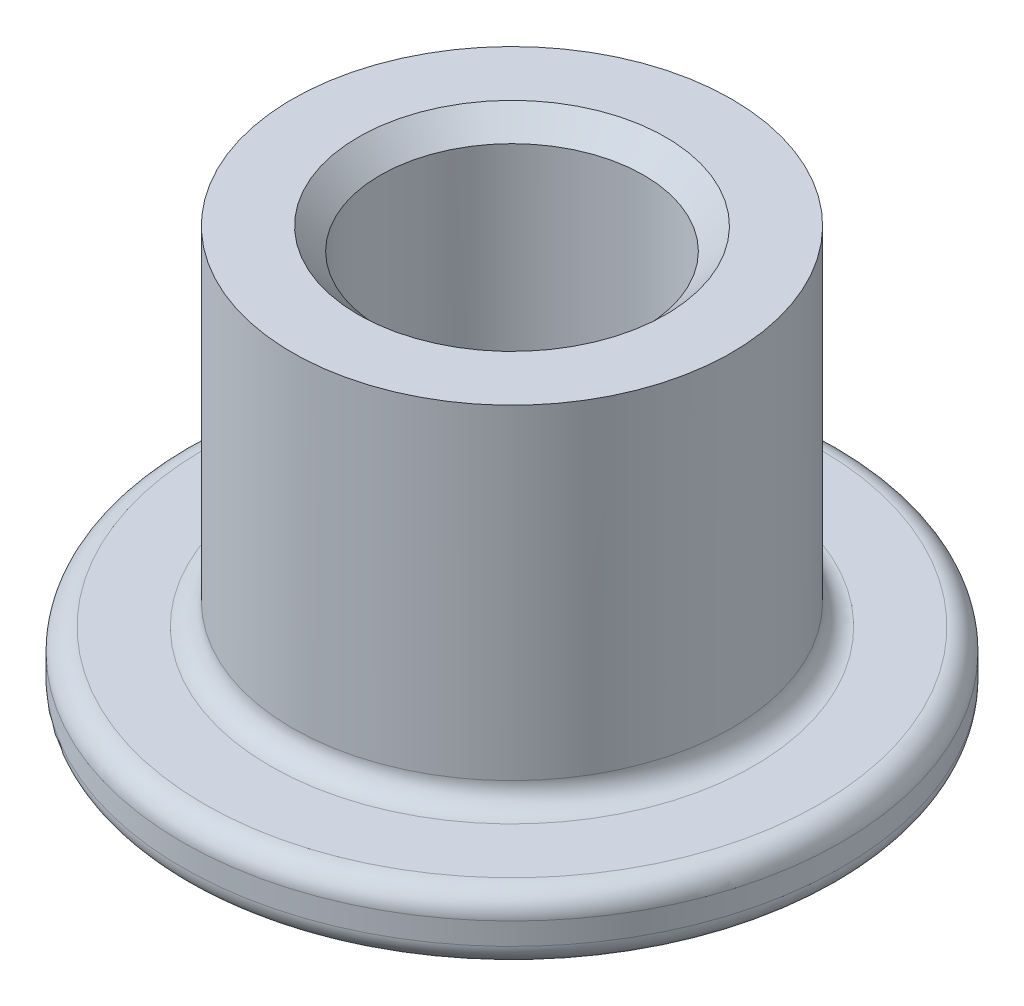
from build123d import *

# Parameters (mm, degrees)
CHANFREIN1_SIZE = 0.5
CONG_1_R        = 0.5


with BuildPart() as part:
    # Esquisse1 → R_volution1 (revolve)
    with BuildSketch(Plane.XY, mode=Mode.PRIVATE) as r_volution1_sk:
        Polygon((3, 0), (7.5, 0), (7.5, 1.5), (5, 1.5), (5, 9.4), (3, 9.4), align=None)
    revolve(r_volution1_sk.sketch.rotate(Axis((0, -18.296610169, 0), (0, 1, 0)), 90), axis=Axis((0, -18.296610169, 0), (0, 1, 0)))

    # Chanfrein1
    chanfrein1_edges = [part.edges().sort_by_distance(p)[0] for p in [
        (0, 9.4, 3),
        (0, 0, 3),
    ]]
    chamfer(chanfrein1_edges, length=CHANFREIN1_SIZE)

    # Cong_1
    cong_1_edges = [part.edges().sort_by_distance(p)[0] for p in [
        (0, 1.5, 5),
        (0, 1.5, 7.5),
        (0, 0, 7.5),
    ]]
    fillet(cong_1_edges, radius=CONG_1_R)


solid = part.part
